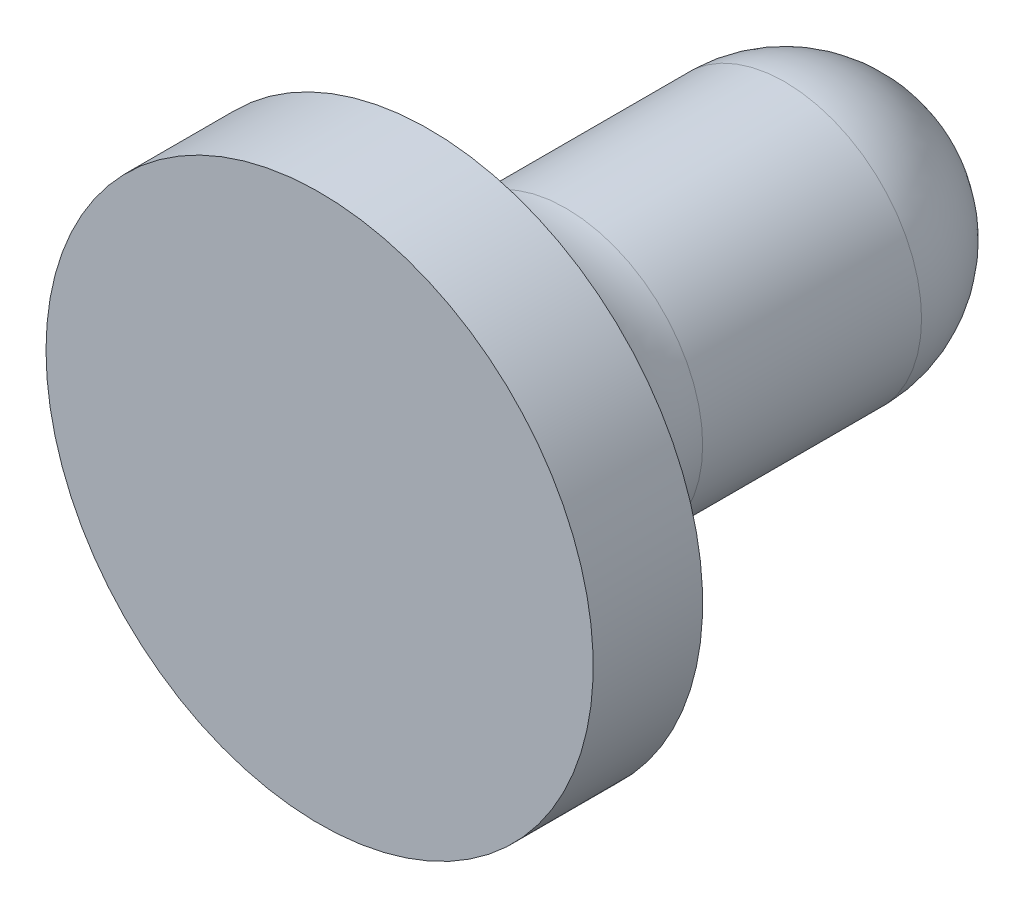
ISO-10303-21;
HEADER;
FILE_DESCRIPTION(('STEP AP214'),'2;1');
FILE_NAME('part.step','',(''),(''),'','','');
FILE_SCHEMA(('AUTOMOTIVE_DESIGN { 1 0 10303 214 1 1 1 1 }'));
ENDSEC;
DATA;
#1=APPLICATION_CONTEXT('core data for automotive mechanical design processes');
#2=APPLICATION_PROTOCOL_DEFINITION('international standard','automotive_design',2000,#1);
#3=PRODUCT_CONTEXT('',#1,'mechanical');
#4=PRODUCT('Part','Part','',(#3));
#5=PRODUCT_RELATED_PRODUCT_CATEGORY('part','',(#4));
#6=PRODUCT_DEFINITION_FORMATION('','',#4);
#7=PRODUCT_DEFINITION_CONTEXT('part definition',#1,'design');
#8=PRODUCT_DEFINITION('design','',#6,#7);
#9=PRODUCT_DEFINITION_SHAPE('','',#8);
#10=(LENGTH_UNIT() NAMED_UNIT(*) SI_UNIT(.MILLI.,.METRE.));
#11=(NAMED_UNIT(*) PLANE_ANGLE_UNIT() SI_UNIT($,.RADIAN.));
#12=(NAMED_UNIT(*) SI_UNIT($,.STERADIAN.) SOLID_ANGLE_UNIT());
#13=UNCERTAINTY_MEASURE_WITH_UNIT(LENGTH_MEASURE(1.E-05),#10,'distance_accuracy_value','');
#14=(GEOMETRIC_REPRESENTATION_CONTEXT(3) GLOBAL_UNCERTAINTY_ASSIGNED_CONTEXT((#13)) GLOBAL_UNIT_ASSIGNED_CONTEXT((#10,
#11,#12)) REPRESENTATION_CONTEXT('',''));
#15=CARTESIAN_POINT('',(0.,0.,0.));
#16=DIRECTION('',(0.,0.,1.));
#17=DIRECTION('',(1.,0.,0.));
#18=AXIS2_PLACEMENT_3D('',#15,#16,#17);
#19=CARTESIAN_POINT('',(0.,0.,-85.));
#20=DIRECTION('',(0.,0.,-1.));
#21=DIRECTION('',(1.,0.,0.));
#22=AXIS2_PLACEMENT_3D('',#19,#20,#21);
#23=SPHERICAL_SURFACE('',#22,25.);
#24=CARTESIAN_POINT('',(0.,0.,-85.));
#25=DIRECTION('',(0.,0.,-1.));
#26=DIRECTION('',(-1.,0.,0.));
#27=AXIS2_PLACEMENT_3D('',#24,#25,#26);
#28=CIRCLE('',#27,25.);
#29=CARTESIAN_POINT('',(-25.,0.,-85.));
#30=VERTEX_POINT('',#29);
#31=EDGE_CURVE('E10',#30,#30,#28,.T.);
#32=ORIENTED_EDGE('',*,*,#31,.T.);
#33=EDGE_LOOP('',(#32));
#34=FACE_BOUND('',#33,.T.);
#35=ADVANCED_FACE('F43',(#34),#23,.T.);
#36=CARTESIAN_POINT('',(0.,0.,-110.));
#37=DIRECTION('',(0.,0.,-1.));
#38=DIRECTION('',(-1.,0.,0.));
#39=AXIS2_PLACEMENT_3D('',#36,#37,#38);
#40=CYLINDRICAL_SURFACE('',#39,25.);
#41=ORIENTED_EDGE('',*,*,#31,.F.);
#42=EDGE_LOOP('',(#41));
#43=FACE_BOUND('',#42,.T.);
#44=CARTESIAN_POINT('',(0.,0.,-45.));
#45=DIRECTION('',(0.,0.,-1.));
#46=DIRECTION('',(-1.,0.,0.));
#47=AXIS2_PLACEMENT_3D('',#44,#45,#46);
#48=CIRCLE('',#47,25.);
#49=CARTESIAN_POINT('',(-25.,0.,-45.));
#50=VERTEX_POINT('',#49);
#51=EDGE_CURVE('E50',#50,#50,#48,.T.);
#52=ORIENTED_EDGE('',*,*,#51,.T.);
#53=EDGE_LOOP('',(#52));
#54=FACE_BOUND('',#53,.T.);
#55=ADVANCED_FACE('F79',(#43,#54),#40,.T.);
#56=CARTESIAN_POINT('',(0.,0.,-45.));
#57=DIRECTION('',(0.,0.,-1.));
#58=DIRECTION('',(-1.,0.,0.));
#59=AXIS2_PLACEMENT_3D('',#56,#57,#58);
#60=TOROIDAL_SURFACE('',#59,50.,25.);
#61=ORIENTED_EDGE('',*,*,#51,.F.);
#62=EDGE_LOOP('',(#61));
#63=FACE_BOUND('',#62,.T.);
#64=CARTESIAN_POINT('',(0.,0.,-20.));
#65=DIRECTION('',(0.,0.,-1.));
#66=DIRECTION('',(-1.,0.,0.));
#67=AXIS2_PLACEMENT_3D('',#64,#65,#66);
#68=CIRCLE('',#67,50.);
#69=CARTESIAN_POINT('',(-50.,0.,-20.));
#70=VERTEX_POINT('',#69);
#71=EDGE_CURVE('E55',#70,#70,#68,.T.);
#72=ORIENTED_EDGE('',*,*,#71,.T.);
#73=EDGE_LOOP('',(#72));
#74=FACE_BOUND('',#73,.T.);
#75=ADVANCED_FACE('F75',(#63,#74),#60,.F.);
#76=CARTESIAN_POINT('',(0.,0.,-110.));
#77=DIRECTION('',(0.,0.,-1.));
#78=DIRECTION('',(-1.,0.,0.));
#79=AXIS2_PLACEMENT_3D('',#76,#77,#78);
#80=CYLINDRICAL_SURFACE('',#79,50.);
#81=ORIENTED_EDGE('',*,*,#71,.F.);
#82=EDGE_LOOP('',(#81));
#83=FACE_BOUND('',#82,.T.);
#84=CARTESIAN_POINT('',(0.,0.,0.));
#85=DIRECTION('',(0.,0.,-1.));
#86=DIRECTION('',(-1.,0.,0.));
#87=AXIS2_PLACEMENT_3D('',#84,#85,#86);
#88=CIRCLE('',#87,50.);
#89=CARTESIAN_POINT('',(-50.,0.,0.));
#90=VERTEX_POINT('',#89);
#91=EDGE_CURVE('E60',#90,#90,#88,.T.);
#92=ORIENTED_EDGE('',*,*,#91,.T.);
#93=EDGE_LOOP('',(#92));
#94=FACE_BOUND('',#93,.T.);
#95=ADVANCED_FACE('F67',(#83,#94),#80,.T.);
#96=CARTESIAN_POINT('',(0.,0.,0.));
#97=DIRECTION('',(0.,0.,-1.));
#98=DIRECTION('',(-1.,0.,0.));
#99=AXIS2_PLACEMENT_3D('',#96,#97,#98);
#100=PLANE('',#99);
#101=ORIENTED_EDGE('',*,*,#91,.F.);
#102=EDGE_LOOP('',(#101));
#103=FACE_BOUND('',#102,.T.);
#104=ADVANCED_FACE('F69',(#103),#100,.F.);
#105=CLOSED_SHELL('',(#35,#55,#75,#95,#104));
#106=MANIFOLD_SOLID_BREP('B2',#105);
#107=ADVANCED_BREP_SHAPE_REPRESENTATION('',(#18,#106),#14);
#108=SHAPE_DEFINITION_REPRESENTATION(#9,#107);
ENDSEC;
END-ISO-10303-21;
